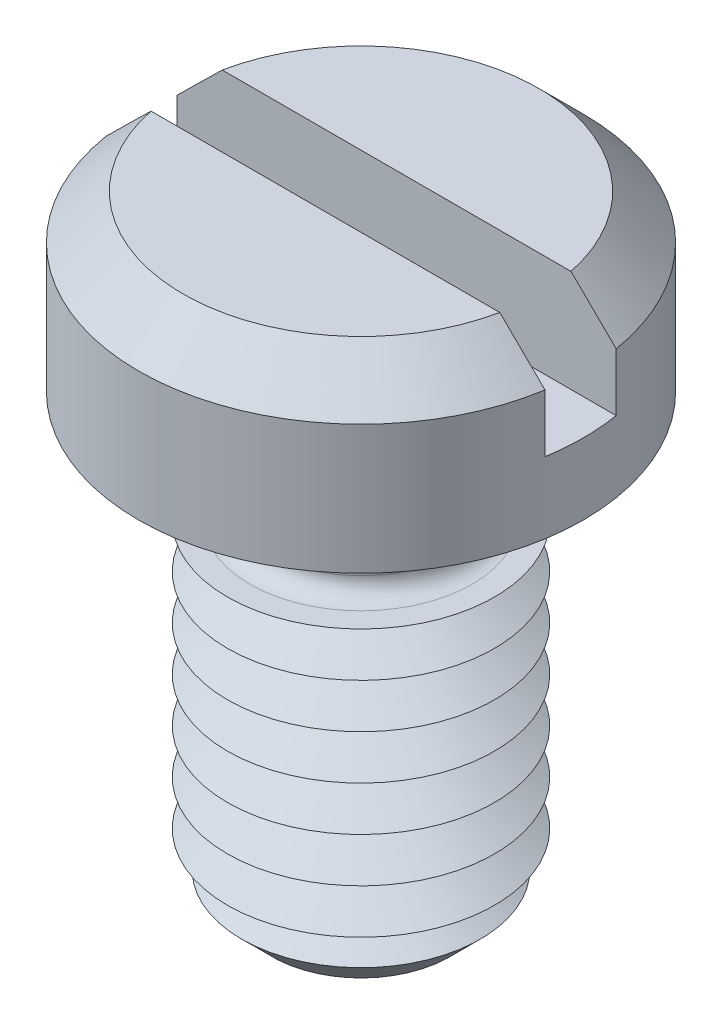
ISO-10303-21;
HEADER;
FILE_DESCRIPTION(('STEP AP214'),'2;1');
FILE_NAME('part.step','',(''),(''),'','','');
FILE_SCHEMA(('AUTOMOTIVE_DESIGN { 1 0 10303 214 1 1 1 1 }'));
ENDSEC;
DATA;
#1=APPLICATION_CONTEXT('core data for automotive mechanical design processes');
#2=APPLICATION_PROTOCOL_DEFINITION('international standard','automotive_design',2000,#1);
#3=PRODUCT_CONTEXT('',#1,'mechanical');
#4=PRODUCT('Part','Part','',(#3));
#5=PRODUCT_RELATED_PRODUCT_CATEGORY('part','',(#4));
#6=PRODUCT_DEFINITION_FORMATION('','',#4);
#7=PRODUCT_DEFINITION_CONTEXT('part definition',#1,'design');
#8=PRODUCT_DEFINITION('design','',#6,#7);
#9=PRODUCT_DEFINITION_SHAPE('','',#8);
#10=(LENGTH_UNIT() NAMED_UNIT(*) SI_UNIT(.MILLI.,.METRE.));
#11=(NAMED_UNIT(*) PLANE_ANGLE_UNIT() SI_UNIT($,.RADIAN.));
#12=(NAMED_UNIT(*) SI_UNIT($,.STERADIAN.) SOLID_ANGLE_UNIT());
#13=UNCERTAINTY_MEASURE_WITH_UNIT(LENGTH_MEASURE(1.E-05),#10,'distance_accuracy_value','');
#14=(GEOMETRIC_REPRESENTATION_CONTEXT(3) GLOBAL_UNCERTAINTY_ASSIGNED_CONTEXT((#13)) GLOBAL_UNIT_ASSIGNED_CONTEXT((#10,
#11,#12)) REPRESENTATION_CONTEXT('',''));
#15=CARTESIAN_POINT('',(0.,0.,0.));
#16=DIRECTION('',(0.,0.,1.));
#17=DIRECTION('',(1.,0.,0.));
#18=AXIS2_PLACEMENT_3D('',#15,#16,#17);
#19=CARTESIAN_POINT('',(0.,3.9,0.));
#20=DIRECTION('',(0.,1.,0.));
#21=DIRECTION('',(0.,0.,1.));
#22=AXIS2_PLACEMENT_3D('',#19,#20,#21);
#23=PLANE('',#22);
#24=DIRECTION('',(-1.,0.,0.));
#25=VECTOR('',#24,1.);
#26=CARTESIAN_POINT('',(5.,3.9,-0.8));
#27=LINE('',#26,#25);
#28=CARTESIAN_POINT('',(3.91918358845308,3.9,-0.8));
#29=VERTEX_POINT('',#28);
#30=CARTESIAN_POINT('',(-3.91918358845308,3.9,-0.8));
#31=VERTEX_POINT('',#30);
#32=EDGE_CURVE('E110',#29,#31,#27,.T.);
#33=ORIENTED_EDGE('',*,*,#32,.F.);
#34=CARTESIAN_POINT('',(0.,3.9,0.));
#35=DIRECTION('',(0.,1.,0.));
#36=DIRECTION('',(0.,0.,1.));
#37=AXIS2_PLACEMENT_3D('',#34,#35,#36);
#38=CIRCLE('',#37,4.);
#39=EDGE_CURVE('E113',#29,#31,#38,.T.);
#40=ORIENTED_EDGE('',*,*,#39,.T.);
#41=EDGE_LOOP('',(#33,#40));
#42=FACE_BOUND('',#41,.T.);
#43=ADVANCED_FACE('F39',(#42),#23,.T.);
#44=CARTESIAN_POINT('',(0.,3.9,0.));
#45=DIRECTION('',(0.,-1.,0.));
#46=DIRECTION('',(0.,0.,-1.));
#47=AXIS2_PLACEMENT_3D('',#44,#45,#46);
#48=CONICAL_SURFACE('',#47,4.,0.785398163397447);
#49=CARTESIAN_POINT('',(11.0010756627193,-3.13012537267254,-0.8));
#50=CARTESIAN_POINT('',(10.6180645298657,-2.74813121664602,-0.8));
#51=CARTESIAN_POINT('',(10.2350087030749,-2.36618183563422,-0.8));
#52=CARTESIAN_POINT('',(9.46873746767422,-1.60241986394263,-0.8));
#53=CARTESIAN_POINT('',(9.08552205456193,-1.22060727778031,-0.8));
#54=CARTESIAN_POINT('',(8.31861292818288,-0.456918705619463,-0.8));
#55=CARTESIAN_POINT('',(7.93491906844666,-0.0750428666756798,-0.8));
#56=CARTESIAN_POINT('',(7.16722555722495,0.688378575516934,-0.8));
#57=CARTESIAN_POINT('',(6.78322591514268,1.06992418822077,-0.8));
#58=CARTESIAN_POINT('',(6.01856215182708,1.82868912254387,-0.8));
#59=CARTESIAN_POINT('',(5.63790309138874,2.20591354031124,-0.8));
#60=CARTESIAN_POINT('',(5.06622054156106,2.7710831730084,-0.8));
#61=CARTESIAN_POINT('',(4.87553531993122,2.9593704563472,-0.8));
#62=CARTESIAN_POINT('',(4.49384424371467,3.33561647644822,-0.8));
#63=CARTESIAN_POINT('',(4.302838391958,3.52357521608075,-0.8));
#64=CARTESIAN_POINT('',(3.92044271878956,3.89893397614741,-0.8));
#65=CARTESIAN_POINT('',(3.7290531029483,4.08633420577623,-0.8));
#66=CARTESIAN_POINT('',(3.34554223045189,4.46039762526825,-0.8));
#67=CARTESIAN_POINT('',(3.15342094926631,4.64706078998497,-0.8));
#68=CARTESIAN_POINT('',(2.76802565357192,5.01913697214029,-0.8));
#69=CARTESIAN_POINT('',(2.57475182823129,5.20455018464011,-0.8));
#70=CARTESIAN_POINT('',(2.28318236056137,5.4809110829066,-0.8));
#71=CARTESIAN_POINT('',(2.1857187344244,5.57273577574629,-0.8));
#72=CARTESIAN_POINT('',(1.98998431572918,5.75552004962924,-0.8));
#73=CARTESIAN_POINT('',(1.89171354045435,5.84647964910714,-0.8));
#74=CARTESIAN_POINT('',(1.76578543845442,5.96147491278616,-0.8));
#75=CARTESIAN_POINT('',(1.73869031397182,5.98612635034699,-0.8));
#76=CARTESIAN_POINT('',(1.68439529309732,6.0353137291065,-0.8));
#77=CARTESIAN_POINT('',(1.65719539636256,6.05984966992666,-0.8));
#78=CARTESIAN_POINT('',(1.57541627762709,6.13326356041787,-0.8));
#79=CARTESIAN_POINT('',(1.52066027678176,6.18194515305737,-0.8));
#80=CARTESIAN_POINT('',(1.41038257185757,6.27874171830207,-0.8));
#81=CARTESIAN_POINT('',(1.35485918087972,6.32685477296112,-0.8));
#82=CARTESIAN_POINT('',(1.24299231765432,6.42210730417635,-0.8));
#83=CARTESIAN_POINT('',(1.18664895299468,6.46924690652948,-0.8));
#84=CARTESIAN_POINT('',(1.07845249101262,6.55754663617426,-0.8));
#85=CARTESIAN_POINT('',(1.02670624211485,6.59883713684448,-0.8));
#86=CARTESIAN_POINT('',(0.921961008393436,6.67979338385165,-0.8));
#87=CARTESIAN_POINT('',(0.868962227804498,6.71945939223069,-0.8));
#88=CARTESIAN_POINT('',(0.761295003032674,6.79630361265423,-0.8));
#89=CARTESIAN_POINT('',(0.706629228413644,6.83348552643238,-0.8));
#90=CARTESIAN_POINT('',(0.594896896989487,6.90399895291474,-0.8));
#91=CARTESIAN_POINT('',(0.5378333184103,6.93733506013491,-0.8));
#92=CARTESIAN_POINT('',(0.428390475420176,6.99356340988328,-0.8));
#93=CARTESIAN_POINT('',(0.376435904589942,7.01726022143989,-0.8));
#94=CARTESIAN_POINT('',(0.269759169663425,7.05717670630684,-0.8));
#95=CARTESIAN_POINT('',(0.215046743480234,7.07342088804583,-0.8));
#96=CARTESIAN_POINT('',(0.113016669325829,7.09332110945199,-0.8));
#97=CARTESIAN_POINT('',(0.066043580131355,7.09866042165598,-0.8));
#98=CARTESIAN_POINT('',(-0.0280587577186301,7.10088875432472,-0.8));
#99=CARTESIAN_POINT('',(-0.0751877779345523,7.09778705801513,-0.8));
#100=CARTESIAN_POINT('',(-0.180723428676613,7.08192474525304,-0.8));
#101=CARTESIAN_POINT('',(-0.238762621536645,7.06679554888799,-0.8));
#102=CARTESIAN_POINT('',(-0.32349937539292,7.03748409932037,-0.8));
#103=CARTESIAN_POINT('',(-0.351441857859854,7.0265659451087,-0.8));
#104=CARTESIAN_POINT('',(-0.40656991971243,7.00295901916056,-0.8));
#105=CARTESIAN_POINT('',(-0.433755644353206,6.99027059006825,-0.8));
#106=CARTESIAN_POINT('',(-0.504673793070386,6.95489235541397,-0.8));
#107=CARTESIAN_POINT('',(-0.547808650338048,6.93101671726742,-0.8));
#108=CARTESIAN_POINT('',(-0.632566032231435,6.88069648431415,-0.8));
#109=CARTESIAN_POINT('',(-0.674187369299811,6.85424992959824,-0.8));
#110=CARTESIAN_POINT('',(-0.756326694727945,6.79950439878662,-0.8));
#111=CARTESIAN_POINT('',(-0.796841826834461,6.77120117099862,-0.8));
#112=CARTESIAN_POINT('',(-0.876938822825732,6.71329852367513,-0.8));
#113=CARTESIAN_POINT('',(-0.916520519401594,6.68369887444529,-0.8));
#114=CARTESIAN_POINT('',(-1.03465904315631,6.59312324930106,-0.8));
#115=CARTESIAN_POINT('',(-1.11211338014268,6.5307142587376,-0.8));
#116=CARTESIAN_POINT('',(-1.26505454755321,6.40381418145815,-0.8));
#117=CARTESIAN_POINT('',(-1.34054439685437,6.33932667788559,-0.8));
#118=CARTESIAN_POINT('',(-1.48913173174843,6.20997083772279,-0.8));
#119=CARTESIAN_POINT('',(-1.5622481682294,6.14512422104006,-0.8));
#120=CARTESIAN_POINT('',(-1.70765393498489,6.01451044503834,-0.8));
#121=CARTESIAN_POINT('',(-1.77994324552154,5.94874326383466,-0.8));
#122=CARTESIAN_POINT('',(-1.99594639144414,5.75046596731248,-0.8));
#123=CARTESIAN_POINT('',(-2.13877767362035,5.61699583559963,-0.8));
#124=CARTESIAN_POINT('',(-2.42324632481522,5.34853800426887,-0.8));
#125=CARTESIAN_POINT('',(-2.56488247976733,5.21354902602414,-0.8));
#126=CARTESIAN_POINT('',(-2.84730929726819,4.94270932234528,-0.8));
#127=CARTESIAN_POINT('',(-2.98810001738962,4.80685865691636,-0.8));
#128=CARTESIAN_POINT('',(-3.26818763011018,4.53549974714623,-0.8));
#129=CARTESIAN_POINT('',(-3.40748821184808,4.39999530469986,-0.8));
#130=CARTESIAN_POINT('',(-3.68570899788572,4.12859172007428,-0.8));
#131=CARTESIAN_POINT('',(-3.82462919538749,3.99269257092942,-0.8));
#132=CARTESIAN_POINT('',(-4.24087543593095,3.58468153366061,-0.8));
#133=CARTESIAN_POINT('',(-4.51779300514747,3.31215310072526,-0.8));
#134=CARTESIAN_POINT('',(-5.05279381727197,2.78443938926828,-0.8));
#135=CARTESIAN_POINT('',(-5.31091639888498,2.52929393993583,-0.8));
#136=CARTESIAN_POINT('',(-5.82680751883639,2.01864429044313,-0.8));
#137=CARTESIAN_POINT('',(-6.08457605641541,1.76314008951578,-0.8));
#138=CARTESIAN_POINT('',(-6.85760508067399,0.996194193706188,-0.8));
#139=CARTESIAN_POINT('',(-7.37251152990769,0.484395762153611,-0.8));
#140=CARTESIAN_POINT('',(-8.40657233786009,-0.544392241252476,-0.8));
#141=CARTESIAN_POINT('',(-8.92572224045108,-1.06138628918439,-0.8));
#142=CARTESIAN_POINT('',(-9.9636287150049,-2.09560660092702,-0.8));
#143=CARTESIAN_POINT('',(-10.4823853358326,-2.61283281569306,-0.8));
#144=CARTESIAN_POINT('',(-11.0010756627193,-3.13012537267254,-0.8));
#145=B_SPLINE_CURVE_WITH_KNOTS('',3,(#49,#50,#51,#52,#53,#54,#55,#56,#57,#58,#59,#60,#61,#62,
#63,#64,#65,#66,#67,#68,#69,#70,#71,#72,#73,#74,#75,#76,#77,#78,#79,#80,#81,#82,#83,#84,#85,#86,
#87,#88,#89,#90,#91,#92,#93,#94,#95,#96,#97,#98,#99,#100,#101,#102,#103,#104,#105,#106,#107,
#108,#109,#110,#111,#112,#113,#114,#115,#116,#117,#118,#119,#120,#121,#122,#123,#124,#125,#126,
#127,#128,#129,#130,#131,#132,#133,#134,#135,#136,#137,#138,#139,#140,#141,#142,#143,#144),
.UNSPECIFIED.,.F.,.F.,(4,2,2,2,2,2,2,2,2,2,2,2,2,2,2,2,2,2,2,2,2,2,2,2,2,2,2,2,2,2,2,2,2,2,2,2,
2,2,2,2,2,2,2,2,2,2,2,4),(0.,1.62282275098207,3.24569489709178,4.86971791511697,
6.49369278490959,8.10142191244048,8.90535980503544,9.7092906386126,10.5128682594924,
11.3164730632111,12.1199494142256,12.5216659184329,12.9233738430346,13.0332669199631,
13.1431603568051,13.3629580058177,13.5833578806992,13.8037290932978,14.0023112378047,
14.2008612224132,14.3991084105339,14.5971162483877,14.7680800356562,14.9384774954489,
15.0795987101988,15.2205647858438,15.3993585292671,15.4893211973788,15.579266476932,
15.727032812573,15.8749126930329,16.0231439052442,16.1714014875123,16.4697244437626,
16.767558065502,17.0607348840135,17.35391868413,17.9403574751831,18.5273336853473,
19.1142694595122,19.6972736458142,20.2802881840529,21.4458742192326,22.5346981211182,
23.6235243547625,25.8015035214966,27.9995014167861,30.1971550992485),.UNSPECIFIED.);
#146=CARTESIAN_POINT('',(4.93558507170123,2.9,-0.8));
#147=VERTEX_POINT('',#146);
#148=EDGE_CURVE('E252',#147,#29,#145,.T.);
#149=ORIENTED_EDGE('',*,*,#148,.F.);
#150=CARTESIAN_POINT('',(0.,2.9,0.));
#151=DIRECTION('',(0.,1.,0.));
#152=DIRECTION('',(0.,0.,1.));
#153=AXIS2_PLACEMENT_3D('',#150,#151,#152);
#154=CIRCLE('',#153,5.);
#155=CARTESIAN_POINT('',(-4.93558507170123,2.9,-0.8));
#156=VERTEX_POINT('',#155);
#157=EDGE_CURVE('E128',#156,#147,#154,.F.);
#158=ORIENTED_EDGE('',*,*,#157,.F.);
#159=EDGE_CURVE('E102',#31,#156,#145,.T.);
#160=ORIENTED_EDGE('',*,*,#159,.F.);
#161=ORIENTED_EDGE('',*,*,#39,.F.);
#162=EDGE_LOOP('',(#149,#158,#160,#161));
#163=FACE_BOUND('',#162,.T.);
#164=ADVANCED_FACE('F214',(#163),#48,.T.);
#165=CARTESIAN_POINT('',(0.,-10.,0.));
#166=DIRECTION('',(0.,1.,0.));
#167=DIRECTION('',(0.,0.,1.));
#168=AXIS2_PLACEMENT_3D('',#165,#166,#167);
#169=CYLINDRICAL_SURFACE('',#168,2.1);
#170=CARTESIAN_POINT('',(0.,-2.1,0.));
#171=DIRECTION('',(0.,-1.,0.));
#172=DIRECTION('',(0.,0.,-1.));
#173=AXIS2_PLACEMENT_3D('',#170,#171,#172);
#174=CIRCLE('',#173,2.1);
#175=CARTESIAN_POINT('',(0.,-2.1,-2.1));
#176=VERTEX_POINT('',#175);
#177=EDGE_CURVE('E123',#176,#176,#174,.F.);
#178=ORIENTED_EDGE('',*,*,#177,.T.);
#179=EDGE_LOOP('',(#178));
#180=FACE_BOUND('',#179,.T.);
#181=CARTESIAN_POINT('',(0.,-0.399999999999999,0.));
#182=DIRECTION('',(0.,1.,0.));
#183=DIRECTION('',(0.,0.,1.));
#184=AXIS2_PLACEMENT_3D('',#181,#182,#183);
#185=CIRCLE('',#184,2.1);
#186=CARTESIAN_POINT('',(0.,-0.399999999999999,2.1));
#187=VERTEX_POINT('',#186);
#188=EDGE_CURVE('E350',#187,#187,#185,.F.);
#189=ORIENTED_EDGE('',*,*,#188,.T.);
#190=EDGE_LOOP('',(#189));
#191=FACE_BOUND('',#190,.T.);
#192=ADVANCED_FACE('F210',(#180,#191),#169,.T.);
#193=CARTESIAN_POINT('',(0.,3.9,0.));
#194=DIRECTION('',(0.,-1.,0.));
#195=DIRECTION('',(0.,0.,-1.));
#196=AXIS2_PLACEMENT_3D('',#193,#194,#195);
#197=CYLINDRICAL_SURFACE('',#196,5.);
#198=ORIENTED_EDGE('',*,*,#157,.T.);
#199=DIRECTION('',(0.,-1.,0.));
#200=VECTOR('',#199,1.);
#201=CARTESIAN_POINT('',(4.93558507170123,3.9,-0.8));
#202=LINE('',#201,#200);
#203=CARTESIAN_POINT('',(4.93558507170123,1.6,-0.8));
#204=VERTEX_POINT('',#203);
#205=EDGE_CURVE('E64',#147,#204,#202,.T.);
#206=ORIENTED_EDGE('',*,*,#205,.T.);
#207=CARTESIAN_POINT('',(0.,1.6,0.));
#208=DIRECTION('',(0.,1.,0.));
#209=DIRECTION('',(0.,0.,1.));
#210=AXIS2_PLACEMENT_3D('',#207,#208,#209);
#211=CIRCLE('',#210,5.);
#212=CARTESIAN_POINT('',(4.93558507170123,1.6,0.8));
#213=VERTEX_POINT('',#212);
#214=EDGE_CURVE('E11',#213,#204,#211,.T.);
#215=ORIENTED_EDGE('',*,*,#214,.F.);
#216=DIRECTION('',(0.,-1.,0.));
#217=VECTOR('',#216,1.);
#218=CARTESIAN_POINT('',(4.93558507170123,3.9,0.8));
#219=LINE('',#218,#217);
#220=CARTESIAN_POINT('',(4.93558507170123,2.9,0.8));
#221=VERTEX_POINT('',#220);
#222=EDGE_CURVE('E268',#213,#221,#219,.F.);
#223=ORIENTED_EDGE('',*,*,#222,.T.);
#224=CARTESIAN_POINT('',(-4.93558507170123,2.9,0.8));
#225=VERTEX_POINT('',#224);
#226=EDGE_CURVE('E120',#221,#225,#154,.F.);
#227=ORIENTED_EDGE('',*,*,#226,.T.);
#228=DIRECTION('',(0.,-1.,0.));
#229=VECTOR('',#228,1.);
#230=CARTESIAN_POINT('',(-4.93558507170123,3.9,0.8));
#231=LINE('',#230,#229);
#232=CARTESIAN_POINT('',(-4.93558507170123,1.6,0.8));
#233=VERTEX_POINT('',#232);
#234=EDGE_CURVE('E96',#225,#233,#231,.T.);
#235=ORIENTED_EDGE('',*,*,#234,.T.);
#236=CARTESIAN_POINT('',(-4.93558507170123,1.6,-0.8));
#237=VERTEX_POINT('',#236);
#238=EDGE_CURVE('E44',#237,#233,#211,.T.);
#239=ORIENTED_EDGE('',*,*,#238,.F.);
#240=DIRECTION('',(0.,-1.,0.));
#241=VECTOR('',#240,1.);
#242=CARTESIAN_POINT('',(-4.93558507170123,3.9,-0.8));
#243=LINE('',#242,#241);
#244=EDGE_CURVE('E272',#237,#156,#243,.F.);
#245=ORIENTED_EDGE('',*,*,#244,.T.);
#246=EDGE_LOOP('',(#198,#206,#215,#223,#227,#235,#239,#245));
#247=FACE_BOUND('',#246,.T.);
#248=CARTESIAN_POINT('',(0.,0.,0.));
#249=DIRECTION('',(0.,1.,0.));
#250=DIRECTION('',(0.,0.,1.));
#251=AXIS2_PLACEMENT_3D('',#248,#249,#250);
#252=CIRCLE('',#251,5.);
#253=CARTESIAN_POINT('',(0.,0.,5.));
#254=VERTEX_POINT('',#253);
#255=EDGE_CURVE('E335',#254,#254,#252,.T.);
#256=ORIENTED_EDGE('',*,*,#255,.T.);
#257=EDGE_LOOP('',(#256));
#258=FACE_BOUND('',#257,.T.);
#259=ADVANCED_FACE('F213',(#247,#258),#197,.T.);
#260=DIRECTION('',(1.,0.,0.));
#261=VECTOR('',#260,1.);
#262=CARTESIAN_POINT('',(5.,3.9,0.8));
#263=LINE('',#262,#261);
#264=CARTESIAN_POINT('',(-3.91918358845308,3.9,0.8));
#265=VERTEX_POINT('',#264);
#266=CARTESIAN_POINT('',(3.91918358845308,3.9,0.8));
#267=VERTEX_POINT('',#266);
#268=EDGE_CURVE('E56',#265,#267,#263,.T.);
#269=ORIENTED_EDGE('',*,*,#268,.F.);
#270=EDGE_CURVE('E108',#265,#267,#38,.T.);
#271=ORIENTED_EDGE('',*,*,#270,.T.);
#272=EDGE_LOOP('',(#269,#271));
#273=FACE_BOUND('',#272,.T.);
#274=ADVANCED_FACE('F107',(#273),#23,.T.);
#275=CARTESIAN_POINT('',(0.,0.,0.));
#276=DIRECTION('',(0.,1.,0.));
#277=DIRECTION('',(0.,0.,1.));
#278=AXIS2_PLACEMENT_3D('',#275,#276,#277);
#279=PLANE('',#278);
#280=CARTESIAN_POINT('',(0.,0.,0.));
#281=DIRECTION('',(0.,1.,0.));
#282=DIRECTION('',(0.,0.,1.));
#283=AXIS2_PLACEMENT_3D('',#280,#281,#282);
#284=CIRCLE('',#283,2.5);
#285=CARTESIAN_POINT('',(0.,0.,2.5));
#286=VERTEX_POINT('',#285);
#287=EDGE_CURVE('E114',#286,#286,#284,.T.);
#288=ORIENTED_EDGE('',*,*,#287,.T.);
#289=EDGE_LOOP('',(#288));
#290=FACE_BOUND('',#289,.T.);
#291=ORIENTED_EDGE('',*,*,#255,.F.);
#292=EDGE_LOOP('',(#291));
#293=FACE_BOUND('',#292,.T.);
#294=ADVANCED_FACE('F204',(#290,#293),#279,.F.);
#295=CARTESIAN_POINT('',(0.,-2.5,0.));
#296=DIRECTION('',(0.,-1.,0.));
#297=DIRECTION('',(0.,0.,-1.));
#298=AXIS2_PLACEMENT_3D('',#295,#296,#297);
#299=PLANE('',#298);
#300=CARTESIAN_POINT('',(0.,-2.5,0.));
#301=DIRECTION('',(0.,-1.,0.));
#302=DIRECTION('',(0.,0.,-1.));
#303=AXIS2_PLACEMENT_3D('',#300,#301,#302);
#304=CIRCLE('',#303,2.5);
#305=CARTESIAN_POINT('',(0.,-2.5,-2.5));
#306=VERTEX_POINT('',#305);
#307=EDGE_CURVE('E343',#306,#306,#304,.T.);
#308=ORIENTED_EDGE('',*,*,#307,.T.);
#309=EDGE_LOOP('',(#308));
#310=FACE_BOUND('',#309,.T.);
#311=CARTESIAN_POINT('',(0.,-2.5,0.));
#312=DIRECTION('',(0.,1.,0.));
#313=DIRECTION('',(0.,0.,1.));
#314=AXIS2_PLACEMENT_3D('',#311,#312,#313);
#315=CIRCLE('',#314,3.);
#316=CARTESIAN_POINT('',(0.,-2.5,3.));
#317=VERTEX_POINT('',#316);
#318=EDGE_CURVE('E331',#317,#317,#315,.T.);
#319=ORIENTED_EDGE('',*,*,#318,.T.);
#320=EDGE_LOOP('',(#319));
#321=FACE_BOUND('',#320,.T.);
#322=ADVANCED_FACE('F200',(#310,#321),#299,.F.);
#323=CARTESIAN_POINT('',(0.,-3.,0.));
#324=DIRECTION('',(0.,1.,0.));
#325=DIRECTION('',(0.,0.,1.));
#326=AXIS2_PLACEMENT_3D('',#323,#324,#325);
#327=CONICAL_SURFACE('',#326,2.13397459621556,1.0471975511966);
#328=ORIENTED_EDGE('',*,*,#318,.F.);
#329=EDGE_LOOP('',(#328));
#330=FACE_BOUND('',#329,.T.);
#331=CARTESIAN_POINT('',(0.,-3.,0.));
#332=DIRECTION('',(0.,1.,0.));
#333=DIRECTION('',(0.,0.,1.));
#334=AXIS2_PLACEMENT_3D('',#331,#332,#333);
#335=CIRCLE('',#334,2.13397459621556);
#336=CARTESIAN_POINT('',(0.,-3.,2.13397459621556));
#337=VERTEX_POINT('',#336);
#338=EDGE_CURVE('E327',#337,#337,#335,.T.);
#339=ORIENTED_EDGE('',*,*,#338,.T.);
#340=EDGE_LOOP('',(#339));
#341=FACE_BOUND('',#340,.T.);
#342=ADVANCED_FACE('F196',(#330,#341),#327,.T.);
#343=CARTESIAN_POINT('',(0.,-3.5,0.));
#344=DIRECTION('',(0.,-1.,0.));
#345=DIRECTION('',(0.,0.,-1.));
#346=AXIS2_PLACEMENT_3D('',#343,#344,#345);
#347=CONICAL_SURFACE('',#346,3.,1.0471975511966);
#348=ORIENTED_EDGE('',*,*,#338,.F.);
#349=EDGE_LOOP('',(#348));
#350=FACE_BOUND('',#349,.T.);
#351=CARTESIAN_POINT('',(0.,-3.5,0.));
#352=DIRECTION('',(0.,1.,0.));
#353=DIRECTION('',(0.,0.,1.));
#354=AXIS2_PLACEMENT_3D('',#351,#352,#353);
#355=CIRCLE('',#354,3.);
#356=CARTESIAN_POINT('',(0.,-3.5,3.));
#357=VERTEX_POINT('',#356);
#358=EDGE_CURVE('E323',#357,#357,#355,.T.);
#359=ORIENTED_EDGE('',*,*,#358,.T.);
#360=EDGE_LOOP('',(#359));
#361=FACE_BOUND('',#360,.T.);
#362=ADVANCED_FACE('F192',(#350,#361),#347,.T.);
#363=CARTESIAN_POINT('',(0.,-4.,0.));
#364=DIRECTION('',(0.,1.,0.));
#365=DIRECTION('',(0.,0.,1.));
#366=AXIS2_PLACEMENT_3D('',#363,#364,#365);
#367=CONICAL_SURFACE('',#366,2.13397459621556,1.0471975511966);
#368=ORIENTED_EDGE('',*,*,#358,.F.);
#369=EDGE_LOOP('',(#368));
#370=FACE_BOUND('',#369,.T.);
#371=CARTESIAN_POINT('',(0.,-4.,0.));
#372=DIRECTION('',(0.,1.,0.));
#373=DIRECTION('',(0.,0.,1.));
#374=AXIS2_PLACEMENT_3D('',#371,#372,#373);
#375=CIRCLE('',#374,2.13397459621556);
#376=CARTESIAN_POINT('',(0.,-4.,2.13397459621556));
#377=VERTEX_POINT('',#376);
#378=EDGE_CURVE('E319',#377,#377,#375,.T.);
#379=ORIENTED_EDGE('',*,*,#378,.T.);
#380=EDGE_LOOP('',(#379));
#381=FACE_BOUND('',#380,.T.);
#382=ADVANCED_FACE('F188',(#370,#381),#367,.T.);
#383=CARTESIAN_POINT('',(0.,-4.5,0.));
#384=DIRECTION('',(0.,-1.,0.));
#385=DIRECTION('',(0.,0.,-1.));
#386=AXIS2_PLACEMENT_3D('',#383,#384,#385);
#387=CONICAL_SURFACE('',#386,3.,1.0471975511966);
#388=ORIENTED_EDGE('',*,*,#378,.F.);
#389=EDGE_LOOP('',(#388));
#390=FACE_BOUND('',#389,.T.);
#391=CARTESIAN_POINT('',(0.,-4.5,0.));
#392=DIRECTION('',(0.,1.,0.));
#393=DIRECTION('',(0.,0.,1.));
#394=AXIS2_PLACEMENT_3D('',#391,#392,#393);
#395=CIRCLE('',#394,3.);
#396=CARTESIAN_POINT('',(0.,-4.5,3.));
#397=VERTEX_POINT('',#396);
#398=EDGE_CURVE('E315',#397,#397,#395,.T.);
#399=ORIENTED_EDGE('',*,*,#398,.T.);
#400=EDGE_LOOP('',(#399));
#401=FACE_BOUND('',#400,.T.);
#402=ADVANCED_FACE('F184',(#390,#401),#387,.T.);
#403=CARTESIAN_POINT('',(0.,-5.,0.));
#404=DIRECTION('',(0.,1.,0.));
#405=DIRECTION('',(0.,0.,1.));
#406=AXIS2_PLACEMENT_3D('',#403,#404,#405);
#407=CONICAL_SURFACE('',#406,2.13397459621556,1.0471975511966);
#408=ORIENTED_EDGE('',*,*,#398,.F.);
#409=EDGE_LOOP('',(#408));
#410=FACE_BOUND('',#409,.T.);
#411=CARTESIAN_POINT('',(0.,-5.,0.));
#412=DIRECTION('',(0.,1.,0.));
#413=DIRECTION('',(0.,0.,1.));
#414=AXIS2_PLACEMENT_3D('',#411,#412,#413);
#415=CIRCLE('',#414,2.13397459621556);
#416=CARTESIAN_POINT('',(0.,-5.,2.13397459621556));
#417=VERTEX_POINT('',#416);
#418=EDGE_CURVE('E311',#417,#417,#415,.T.);
#419=ORIENTED_EDGE('',*,*,#418,.T.);
#420=EDGE_LOOP('',(#419));
#421=FACE_BOUND('',#420,.T.);
#422=ADVANCED_FACE('F180',(#410,#421),#407,.T.);
#423=CARTESIAN_POINT('',(0.,-5.5,0.));
#424=DIRECTION('',(0.,-1.,0.));
#425=DIRECTION('',(0.,0.,-1.));
#426=AXIS2_PLACEMENT_3D('',#423,#424,#425);
#427=CONICAL_SURFACE('',#426,3.,1.0471975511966);
#428=ORIENTED_EDGE('',*,*,#418,.F.);
#429=EDGE_LOOP('',(#428));
#430=FACE_BOUND('',#429,.T.);
#431=CARTESIAN_POINT('',(0.,-5.5,0.));
#432=DIRECTION('',(0.,1.,0.));
#433=DIRECTION('',(0.,0.,1.));
#434=AXIS2_PLACEMENT_3D('',#431,#432,#433);
#435=CIRCLE('',#434,3.);
#436=CARTESIAN_POINT('',(0.,-5.5,3.));
#437=VERTEX_POINT('',#436);
#438=EDGE_CURVE('E308',#437,#437,#435,.T.);
#439=ORIENTED_EDGE('',*,*,#438,.T.);
#440=EDGE_LOOP('',(#439));
#441=FACE_BOUND('',#440,.T.);
#442=ADVANCED_FACE('F176',(#430,#441),#427,.T.);
#443=CARTESIAN_POINT('',(0.,-6.,0.));
#444=DIRECTION('',(0.,1.,0.));
#445=DIRECTION('',(0.,0.,1.));
#446=AXIS2_PLACEMENT_3D('',#443,#444,#445);
#447=CONICAL_SURFACE('',#446,2.13397459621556,1.0471975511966);
#448=ORIENTED_EDGE('',*,*,#438,.F.);
#449=EDGE_LOOP('',(#448));
#450=FACE_BOUND('',#449,.T.);
#451=CARTESIAN_POINT('',(0.,-6.,0.));
#452=DIRECTION('',(0.,1.,0.));
#453=DIRECTION('',(0.,0.,1.));
#454=AXIS2_PLACEMENT_3D('',#451,#452,#453);
#455=CIRCLE('',#454,2.13397459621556);
#456=CARTESIAN_POINT('',(0.,-6.,2.13397459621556));
#457=VERTEX_POINT('',#456);
#458=EDGE_CURVE('E304',#457,#457,#455,.T.);
#459=ORIENTED_EDGE('',*,*,#458,.T.);
#460=EDGE_LOOP('',(#459));
#461=FACE_BOUND('',#460,.T.);
#462=ADVANCED_FACE('F172',(#450,#461),#447,.T.);
#463=CARTESIAN_POINT('',(0.,-6.5,0.));
#464=DIRECTION('',(0.,-1.,0.));
#465=DIRECTION('',(0.,0.,-1.));
#466=AXIS2_PLACEMENT_3D('',#463,#464,#465);
#467=CONICAL_SURFACE('',#466,3.,1.0471975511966);
#468=ORIENTED_EDGE('',*,*,#458,.F.);
#469=EDGE_LOOP('',(#468));
#470=FACE_BOUND('',#469,.T.);
#471=CARTESIAN_POINT('',(0.,-6.5,0.));
#472=DIRECTION('',(0.,1.,0.));
#473=DIRECTION('',(0.,0.,1.));
#474=AXIS2_PLACEMENT_3D('',#471,#472,#473);
#475=CIRCLE('',#474,3.);
#476=CARTESIAN_POINT('',(0.,-6.5,3.));
#477=VERTEX_POINT('',#476);
#478=EDGE_CURVE('E300',#477,#477,#475,.T.);
#479=ORIENTED_EDGE('',*,*,#478,.T.);
#480=EDGE_LOOP('',(#479));
#481=FACE_BOUND('',#480,.T.);
#482=ADVANCED_FACE('F168',(#470,#481),#467,.T.);
#483=CARTESIAN_POINT('',(0.,-7.,0.));
#484=DIRECTION('',(0.,1.,0.));
#485=DIRECTION('',(0.,0.,1.));
#486=AXIS2_PLACEMENT_3D('',#483,#484,#485);
#487=CONICAL_SURFACE('',#486,2.13397459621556,1.0471975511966);
#488=ORIENTED_EDGE('',*,*,#478,.F.);
#489=EDGE_LOOP('',(#488));
#490=FACE_BOUND('',#489,.T.);
#491=CARTESIAN_POINT('',(0.,-7.,0.));
#492=DIRECTION('',(0.,1.,0.));
#493=DIRECTION('',(0.,0.,1.));
#494=AXIS2_PLACEMENT_3D('',#491,#492,#493);
#495=CIRCLE('',#494,2.13397459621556);
#496=CARTESIAN_POINT('',(0.,-7.,2.13397459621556));
#497=VERTEX_POINT('',#496);
#498=EDGE_CURVE('E296',#497,#497,#495,.T.);
#499=ORIENTED_EDGE('',*,*,#498,.T.);
#500=EDGE_LOOP('',(#499));
#501=FACE_BOUND('',#500,.T.);
#502=ADVANCED_FACE('F164',(#490,#501),#487,.T.);
#503=CARTESIAN_POINT('',(0.,-7.5,0.));
#504=DIRECTION('',(0.,-1.,0.));
#505=DIRECTION('',(0.,0.,-1.));
#506=AXIS2_PLACEMENT_3D('',#503,#504,#505);
#507=CONICAL_SURFACE('',#506,3.,1.0471975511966);
#508=ORIENTED_EDGE('',*,*,#498,.F.);
#509=EDGE_LOOP('',(#508));
#510=FACE_BOUND('',#509,.T.);
#511=CARTESIAN_POINT('',(0.,-7.5,0.));
#512=DIRECTION('',(0.,1.,0.));
#513=DIRECTION('',(0.,0.,1.));
#514=AXIS2_PLACEMENT_3D('',#511,#512,#513);
#515=CIRCLE('',#514,3.);
#516=CARTESIAN_POINT('',(0.,-7.5,3.));
#517=VERTEX_POINT('',#516);
#518=EDGE_CURVE('E292',#517,#517,#515,.T.);
#519=ORIENTED_EDGE('',*,*,#518,.T.);
#520=EDGE_LOOP('',(#519));
#521=FACE_BOUND('',#520,.T.);
#522=ADVANCED_FACE('F160',(#510,#521),#507,.T.);
#523=CARTESIAN_POINT('',(0.,-8.,0.));
#524=DIRECTION('',(0.,1.,0.));
#525=DIRECTION('',(0.,0.,1.));
#526=AXIS2_PLACEMENT_3D('',#523,#524,#525);
#527=CONICAL_SURFACE('',#526,2.13397459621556,1.0471975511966);
#528=ORIENTED_EDGE('',*,*,#518,.F.);
#529=EDGE_LOOP('',(#528));
#530=FACE_BOUND('',#529,.T.);
#531=CARTESIAN_POINT('',(0.,-8.,0.));
#532=DIRECTION('',(0.,1.,0.));
#533=DIRECTION('',(0.,0.,1.));
#534=AXIS2_PLACEMENT_3D('',#531,#532,#533);
#535=CIRCLE('',#534,2.13397459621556);
#536=CARTESIAN_POINT('',(0.,-8.,2.13397459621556));
#537=VERTEX_POINT('',#536);
#538=EDGE_CURVE('E288',#537,#537,#535,.T.);
#539=ORIENTED_EDGE('',*,*,#538,.T.);
#540=EDGE_LOOP('',(#539));
#541=FACE_BOUND('',#540,.T.);
#542=ADVANCED_FACE('F156',(#530,#541),#527,.T.);
#543=CARTESIAN_POINT('',(0.,-8.5,0.));
#544=DIRECTION('',(0.,-1.,0.));
#545=DIRECTION('',(0.,0.,-1.));
#546=AXIS2_PLACEMENT_3D('',#543,#544,#545);
#547=CONICAL_SURFACE('',#546,3.,1.0471975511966);
#548=ORIENTED_EDGE('',*,*,#538,.F.);
#549=EDGE_LOOP('',(#548));
#550=FACE_BOUND('',#549,.T.);
#551=CARTESIAN_POINT('',(0.,-8.5,0.));
#552=DIRECTION('',(0.,1.,0.));
#553=DIRECTION('',(0.,0.,1.));
#554=AXIS2_PLACEMENT_3D('',#551,#552,#553);
#555=CIRCLE('',#554,3.);
#556=CARTESIAN_POINT('',(0.,-8.5,3.));
#557=VERTEX_POINT('',#556);
#558=EDGE_CURVE('E284',#557,#557,#555,.T.);
#559=ORIENTED_EDGE('',*,*,#558,.T.);
#560=EDGE_LOOP('',(#559));
#561=FACE_BOUND('',#560,.T.);
#562=ADVANCED_FACE('F152',(#550,#561),#547,.T.);
#563=CARTESIAN_POINT('',(0.,-9.,0.));
#564=DIRECTION('',(0.,1.,0.));
#565=DIRECTION('',(0.,0.,1.));
#566=AXIS2_PLACEMENT_3D('',#563,#564,#565);
#567=CONICAL_SURFACE('',#566,2.13397459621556,1.0471975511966);
#568=ORIENTED_EDGE('',*,*,#558,.F.);
#569=EDGE_LOOP('',(#568));
#570=FACE_BOUND('',#569,.T.);
#571=CARTESIAN_POINT('',(0.,-9.,0.));
#572=DIRECTION('',(0.,1.,0.));
#573=DIRECTION('',(0.,0.,1.));
#574=AXIS2_PLACEMENT_3D('',#571,#572,#573);
#575=CIRCLE('',#574,2.13397459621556);
#576=CARTESIAN_POINT('',(0.,-9.,2.13397459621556));
#577=VERTEX_POINT('',#576);
#578=EDGE_CURVE('E280',#577,#577,#575,.T.);
#579=ORIENTED_EDGE('',*,*,#578,.T.);
#580=EDGE_LOOP('',(#579));
#581=FACE_BOUND('',#580,.T.);
#582=ADVANCED_FACE('F148',(#570,#581),#567,.T.);
#583=CARTESIAN_POINT('',(0.,-9.5,0.));
#584=DIRECTION('',(0.,-1.,0.));
#585=DIRECTION('',(0.,0.,-1.));
#586=AXIS2_PLACEMENT_3D('',#583,#584,#585);
#587=CONICAL_SURFACE('',#586,3.,1.0471975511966);
#588=CARTESIAN_POINT('',(0.,-9.31698729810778,0.));
#589=DIRECTION('',(0.,-1.,0.));
#590=DIRECTION('',(0.,0.,-1.));
#591=AXIS2_PLACEMENT_3D('',#588,#589,#590);
#592=CIRCLE('',#591,2.68301270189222);
#593=CARTESIAN_POINT('',(0.,-9.31698729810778,-2.68301270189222));
#594=VERTEX_POINT('',#593);
#595=EDGE_CURVE('E287',#594,#594,#592,.F.);
#596=ORIENTED_EDGE('',*,*,#595,.T.);
#597=EDGE_LOOP('',(#596));
#598=FACE_BOUND('',#597,.T.);
#599=ORIENTED_EDGE('',*,*,#578,.F.);
#600=EDGE_LOOP('',(#599));
#601=FACE_BOUND('',#600,.T.);
#602=ADVANCED_FACE('F144',(#598,#601),#587,.T.);
#603=CARTESIAN_POINT('',(0.,-10.,0.));
#604=DIRECTION('',(0.,-1.,0.));
#605=DIRECTION('',(0.,0.,-1.));
#606=AXIS2_PLACEMENT_3D('',#603,#604,#605);
#607=PLANE('',#606);
#608=CARTESIAN_POINT('',(0.,-10.,0.));
#609=DIRECTION('',(0.,-1.,0.));
#610=DIRECTION('',(0.,0.,-1.));
#611=AXIS2_PLACEMENT_3D('',#608,#609,#610);
#612=CIRCLE('',#611,2.);
#613=CARTESIAN_POINT('',(0.,-10.,-2.));
#614=VERTEX_POINT('',#613);
#615=EDGE_CURVE('E339',#614,#614,#612,.T.);
#616=ORIENTED_EDGE('',*,*,#615,.T.);
#617=EDGE_LOOP('',(#616));
#618=FACE_BOUND('',#617,.T.);
#619=ADVANCED_FACE('F147',(#618),#607,.T.);
#620=CARTESIAN_POINT('',(0.,-10.,0.));
#621=DIRECTION('',(0.,1.,0.));
#622=DIRECTION('',(0.,0.,1.));
#623=AXIS2_PLACEMENT_3D('',#620,#621,#622);
#624=CONICAL_SURFACE('',#623,2.,0.785398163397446);
#625=ORIENTED_EDGE('',*,*,#595,.F.);
#626=EDGE_LOOP('',(#625));
#627=FACE_BOUND('',#626,.T.);
#628=ORIENTED_EDGE('',*,*,#615,.F.);
#629=EDGE_LOOP('',(#628));
#630=FACE_BOUND('',#629,.T.);
#631=ADVANCED_FACE('F208',(#627,#630),#624,.T.);
#632=CARTESIAN_POINT('',(0.,-2.1,0.));
#633=DIRECTION('',(0.,-1.,0.));
#634=DIRECTION('',(0.,0.,-1.));
#635=AXIS2_PLACEMENT_3D('',#632,#633,#634);
#636=TOROIDAL_SURFACE('',#635,2.5,0.4);
#637=ORIENTED_EDGE('',*,*,#177,.F.);
#638=EDGE_LOOP('',(#637));
#639=FACE_BOUND('',#638,.T.);
#640=ORIENTED_EDGE('',*,*,#307,.F.);
#641=EDGE_LOOP('',(#640));
#642=FACE_BOUND('',#641,.T.);
#643=ADVANCED_FACE('F226',(#639,#642),#636,.F.);
#644=CARTESIAN_POINT('',(0.,-0.399999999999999,0.));
#645=DIRECTION('',(0.,1.,0.));
#646=DIRECTION('',(0.,0.,1.));
#647=AXIS2_PLACEMENT_3D('',#644,#645,#646);
#648=TOROIDAL_SURFACE('',#647,2.5,0.4);
#649=ORIENTED_EDGE('',*,*,#287,.F.);
#650=EDGE_LOOP('',(#649));
#651=FACE_BOUND('',#650,.T.);
#652=ORIENTED_EDGE('',*,*,#188,.F.);
#653=EDGE_LOOP('',(#652));
#654=FACE_BOUND('',#653,.T.);
#655=ADVANCED_FACE('F229',(#651,#654),#648,.F.);
#656=CARTESIAN_POINT('',(-11.0010756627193,-3.13012537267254,0.8));
#657=CARTESIAN_POINT('',(-10.6180645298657,-2.74813121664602,0.8));
#658=CARTESIAN_POINT('',(-10.2350087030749,-2.36618183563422,0.8));
#659=CARTESIAN_POINT('',(-9.46873746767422,-1.60241986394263,0.8));
#660=CARTESIAN_POINT('',(-9.08552205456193,-1.22060727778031,0.8));
#661=CARTESIAN_POINT('',(-8.31861292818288,-0.456918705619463,0.8));
#662=CARTESIAN_POINT('',(-7.93491906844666,-0.0750428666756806,0.8));
#663=CARTESIAN_POINT('',(-7.16722555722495,0.688378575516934,0.8));
#664=CARTESIAN_POINT('',(-6.78322591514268,1.06992418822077,0.8));
#665=CARTESIAN_POINT('',(-6.01856215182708,1.82868912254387,0.8));
#666=CARTESIAN_POINT('',(-5.63790309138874,2.20591354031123,0.8));
#667=CARTESIAN_POINT('',(-5.06622054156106,2.7710831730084,0.8));
#668=CARTESIAN_POINT('',(-4.87553531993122,2.9593704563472,0.8));
#669=CARTESIAN_POINT('',(-4.49384424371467,3.33561647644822,0.8));
#670=CARTESIAN_POINT('',(-4.30283839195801,3.52357521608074,0.8));
#671=CARTESIAN_POINT('',(-3.92044271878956,3.89893397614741,0.8));
#672=CARTESIAN_POINT('',(-3.72905310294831,4.08633420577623,0.8));
#673=CARTESIAN_POINT('',(-3.34554223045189,4.46039762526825,0.8));
#674=CARTESIAN_POINT('',(-3.15342094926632,4.64706078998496,0.8));
#675=CARTESIAN_POINT('',(-2.76802565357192,5.01913697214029,0.8));
#676=CARTESIAN_POINT('',(-2.57475182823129,5.2045501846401,0.8));
#677=CARTESIAN_POINT('',(-2.28318236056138,5.4809110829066,0.8));
#678=CARTESIAN_POINT('',(-2.1857187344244,5.57273577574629,0.8));
#679=CARTESIAN_POINT('',(-1.98998431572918,5.75552004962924,0.8));
#680=CARTESIAN_POINT('',(-1.89171354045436,5.84647964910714,0.8));
#681=CARTESIAN_POINT('',(-1.76578543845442,5.96147491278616,0.8));
#682=CARTESIAN_POINT('',(-1.73869031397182,5.98612635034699,0.8));
#683=CARTESIAN_POINT('',(-1.68439529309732,6.0353137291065,0.8));
#684=CARTESIAN_POINT('',(-1.65719539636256,6.05984966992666,0.8));
#685=CARTESIAN_POINT('',(-1.5754162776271,6.13326356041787,0.8));
#686=CARTESIAN_POINT('',(-1.52066027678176,6.18194515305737,0.8));
#687=CARTESIAN_POINT('',(-1.41038257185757,6.27874171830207,0.8));
#688=CARTESIAN_POINT('',(-1.35485918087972,6.32685477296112,0.8));
#689=CARTESIAN_POINT('',(-1.24299231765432,6.42210730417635,0.8));
#690=CARTESIAN_POINT('',(-1.18664895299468,6.46924690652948,0.8));
#691=CARTESIAN_POINT('',(-1.07845249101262,6.55754663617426,0.8));
#692=CARTESIAN_POINT('',(-1.02670624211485,6.59883713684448,0.8));
#693=CARTESIAN_POINT('',(-0.921961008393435,6.67979338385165,0.8));
#694=CARTESIAN_POINT('',(-0.868962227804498,6.71945939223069,0.8));
#695=CARTESIAN_POINT('',(-0.761295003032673,6.79630361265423,0.8));
#696=CARTESIAN_POINT('',(-0.706629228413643,6.83348552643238,0.8));
#697=CARTESIAN_POINT('',(-0.594896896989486,6.90399895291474,0.8));
#698=CARTESIAN_POINT('',(-0.537833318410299,6.93733506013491,0.8));
#699=CARTESIAN_POINT('',(-0.428390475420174,6.99356340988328,0.8));
#700=CARTESIAN_POINT('',(-0.37643590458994,7.01726022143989,0.8));
#701=CARTESIAN_POINT('',(-0.269759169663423,7.05717670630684,0.8));
#702=CARTESIAN_POINT('',(-0.215046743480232,7.07342088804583,0.8));
#703=CARTESIAN_POINT('',(-0.113016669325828,7.093321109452,0.8));
#704=CARTESIAN_POINT('',(-0.0660435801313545,7.09866042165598,0.8));
#705=CARTESIAN_POINT('',(0.0280587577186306,7.10088875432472,0.8));
#706=CARTESIAN_POINT('',(0.0751877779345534,7.09778705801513,0.8));
#707=CARTESIAN_POINT('',(0.180723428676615,7.08192474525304,0.8));
#708=CARTESIAN_POINT('',(0.238762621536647,7.06679554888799,0.8));
#709=CARTESIAN_POINT('',(0.323499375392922,7.03748409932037,0.8));
#710=CARTESIAN_POINT('',(0.351441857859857,7.02656594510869,0.8));
#711=CARTESIAN_POINT('',(0.406569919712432,7.00295901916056,0.8));
#712=CARTESIAN_POINT('',(0.433755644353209,6.99027059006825,0.8));
#713=CARTESIAN_POINT('',(0.504673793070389,6.95489235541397,0.8));
#714=CARTESIAN_POINT('',(0.547808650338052,6.93101671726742,0.8));
#715=CARTESIAN_POINT('',(0.63256603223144,6.88069648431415,0.8));
#716=CARTESIAN_POINT('',(0.674187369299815,6.85424992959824,0.8));
#717=CARTESIAN_POINT('',(0.756326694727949,6.79950439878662,0.8));
#718=CARTESIAN_POINT('',(0.796841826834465,6.77120117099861,0.8));
#719=CARTESIAN_POINT('',(0.876938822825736,6.71329852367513,0.8));
#720=CARTESIAN_POINT('',(0.916520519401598,6.68369887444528,0.8));
#721=CARTESIAN_POINT('',(1.03465904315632,6.59312324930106,0.8));
#722=CARTESIAN_POINT('',(1.11211338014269,6.5307142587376,0.8));
#723=CARTESIAN_POINT('',(1.26505454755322,6.40381418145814,0.8));
#724=CARTESIAN_POINT('',(1.34054439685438,6.33932667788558,0.8));
#725=CARTESIAN_POINT('',(1.48913173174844,6.20997083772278,0.8));
#726=CARTESIAN_POINT('',(1.56224816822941,6.14512422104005,0.8));
#727=CARTESIAN_POINT('',(1.7076539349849,6.01451044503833,0.8));
#728=CARTESIAN_POINT('',(1.77994324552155,5.94874326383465,0.8));
#729=CARTESIAN_POINT('',(1.99594639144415,5.75046596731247,0.8));
#730=CARTESIAN_POINT('',(2.13877767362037,5.61699583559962,0.8));
#731=CARTESIAN_POINT('',(2.42324632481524,5.34853800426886,0.8));
#732=CARTESIAN_POINT('',(2.56488247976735,5.21354902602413,0.8));
#733=CARTESIAN_POINT('',(2.84730929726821,4.94270932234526,0.8));
#734=CARTESIAN_POINT('',(2.98810001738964,4.80685865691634,0.8));
#735=CARTESIAN_POINT('',(3.2681876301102,4.53549974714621,0.8));
#736=CARTESIAN_POINT('',(3.4074882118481,4.39999530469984,0.8));
#737=CARTESIAN_POINT('',(3.68570899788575,4.12859172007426,0.8));
#738=CARTESIAN_POINT('',(3.82462919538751,3.9926925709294,0.8));
#739=CARTESIAN_POINT('',(4.24087543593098,3.58468153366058,0.8));
#740=CARTESIAN_POINT('',(4.5177930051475,3.31215310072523,0.8));
#741=CARTESIAN_POINT('',(5.052793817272,2.78443938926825,0.8));
#742=CARTESIAN_POINT('',(5.31091639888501,2.52929393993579,0.8));
#743=CARTESIAN_POINT('',(5.82680751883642,2.0186442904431,0.8));
#744=CARTESIAN_POINT('',(6.08457605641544,1.76314008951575,0.8));
#745=CARTESIAN_POINT('',(6.85760508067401,0.996194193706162,0.8));
#746=CARTESIAN_POINT('',(7.37251152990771,0.484395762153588,0.8));
#747=CARTESIAN_POINT('',(8.4065723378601,-0.544392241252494,0.8));
#748=CARTESIAN_POINT('',(8.9257222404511,-1.0613862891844,0.8));
#749=CARTESIAN_POINT('',(9.96362871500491,-2.09560660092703,0.8));
#750=CARTESIAN_POINT('',(10.4823853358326,-2.61283281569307,0.8));
#751=CARTESIAN_POINT('',(11.0010756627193,-3.13012537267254,0.8));
#752=B_SPLINE_CURVE_WITH_KNOTS('',3,(#656,#657,#658,#659,#660,#661,#662,#663,#664,#665,#666,
#667,#668,#669,#670,#671,#672,#673,#674,#675,#676,#677,#678,#679,#680,#681,#682,#683,#684,#685,
#686,#687,#688,#689,#690,#691,#692,#693,#694,#695,#696,#697,#698,#699,#700,#701,#702,#703,#704,
#705,#706,#707,#708,#709,#710,#711,#712,#713,#714,#715,#716,#717,#718,#719,#720,#721,#722,#723,
#724,#725,#726,#727,#728,#729,#730,#731,#732,#733,#734,#735,#736,#737,#738,#739,#740,#741,#742,
#743,#744,#745,#746,#747,#748,#749,#750,#751),.UNSPECIFIED.,.F.,.F.,(4,2,2,2,2,2,2,2,2,2,2,2,2,
2,2,2,2,2,2,2,2,2,2,2,2,2,2,2,2,2,2,2,2,2,2,2,2,2,2,2,2,2,2,2,2,2,2,4),(0.,1.62282275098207,
3.24569489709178,4.86971791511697,6.49369278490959,8.10142191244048,8.90535980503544,
9.7092906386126,10.5128682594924,11.3164730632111,12.1199494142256,12.5216659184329,
12.9233738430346,13.0332669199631,13.1431603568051,13.3629580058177,13.5833578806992,
13.8037290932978,14.0023112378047,14.2008612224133,14.3991084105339,14.5971162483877,
14.7680800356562,14.9384774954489,15.0795987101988,15.2205647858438,15.3993585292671,
15.4893211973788,15.5792664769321,15.727032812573,15.8749126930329,16.0231439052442,
16.1714014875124,16.4697244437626,16.767558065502,17.0607348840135,17.35391868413,
17.9403574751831,18.5273336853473,19.1142694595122,19.6972736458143,20.2802881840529,
21.4458742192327,22.5346981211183,23.6235243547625,25.8015035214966,27.9995014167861,
30.1971550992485),.UNSPECIFIED.);
#753=EDGE_CURVE('E92',#225,#265,#752,.T.);
#754=ORIENTED_EDGE('',*,*,#753,.F.);
#755=ORIENTED_EDGE('',*,*,#226,.F.);
#756=EDGE_CURVE('E103',#267,#221,#752,.T.);
#757=ORIENTED_EDGE('',*,*,#756,.F.);
#758=ORIENTED_EDGE('',*,*,#270,.F.);
#759=EDGE_LOOP('',(#754,#755,#757,#758));
#760=FACE_BOUND('',#759,.T.);
#761=ADVANCED_FACE('F41',(#760),#48,.T.);
#762=CARTESIAN_POINT('',(0.,1.6,0.));
#763=DIRECTION('',(0.,1.,0.));
#764=DIRECTION('',(0.,0.,1.));
#765=AXIS2_PLACEMENT_3D('',#762,#763,#764);
#766=PLANE('',#765);
#767=DIRECTION('',(1.,0.,0.));
#768=VECTOR('',#767,1.);
#769=CARTESIAN_POINT('',(5.,1.6,0.8));
#770=LINE('',#769,#768);
#771=EDGE_CURVE('E249',#233,#213,#770,.T.);
#772=ORIENTED_EDGE('',*,*,#771,.T.);
#773=ORIENTED_EDGE('',*,*,#214,.T.);
#774=DIRECTION('',(-1.,0.,0.));
#775=VECTOR('',#774,1.);
#776=CARTESIAN_POINT('',(5.,1.6,-0.8));
#777=LINE('',#776,#775);
#778=EDGE_CURVE('E265',#204,#237,#777,.T.);
#779=ORIENTED_EDGE('',*,*,#778,.T.);
#780=ORIENTED_EDGE('',*,*,#238,.T.);
#781=EDGE_LOOP('',(#772,#773,#779,#780));
#782=FACE_BOUND('',#781,.T.);
#783=ADVANCED_FACE('F236',(#782),#766,.T.);
#784=CARTESIAN_POINT('',(5.,1.6,-0.8));
#785=DIRECTION('',(0.,0.,-1.));
#786=DIRECTION('',(-1.,0.,0.));
#787=AXIS2_PLACEMENT_3D('',#784,#785,#786);
#788=PLANE('',#787);
#789=ORIENTED_EDGE('',*,*,#148,.T.);
#790=ORIENTED_EDGE('',*,*,#32,.T.);
#791=ORIENTED_EDGE('',*,*,#159,.T.);
#792=ORIENTED_EDGE('',*,*,#244,.F.);
#793=ORIENTED_EDGE('',*,*,#778,.F.);
#794=ORIENTED_EDGE('',*,*,#205,.F.);
#795=EDGE_LOOP('',(#789,#790,#791,#792,#793,#794));
#796=FACE_BOUND('',#795,.T.);
#797=ADVANCED_FACE('F141',(#796),#788,.F.);
#798=CARTESIAN_POINT('',(5.,1.6,0.8));
#799=DIRECTION('',(0.,0.,1.));
#800=DIRECTION('',(1.,0.,0.));
#801=AXIS2_PLACEMENT_3D('',#798,#799,#800);
#802=PLANE('',#801);
#803=ORIENTED_EDGE('',*,*,#753,.T.);
#804=ORIENTED_EDGE('',*,*,#268,.T.);
#805=ORIENTED_EDGE('',*,*,#756,.T.);
#806=ORIENTED_EDGE('',*,*,#222,.F.);
#807=ORIENTED_EDGE('',*,*,#771,.F.);
#808=ORIENTED_EDGE('',*,*,#234,.F.);
#809=EDGE_LOOP('',(#803,#804,#805,#806,#807,#808));
#810=FACE_BOUND('',#809,.T.);
#811=ADVANCED_FACE('F93',(#810),#802,.F.);
#812=CLOSED_SHELL('',(#43,#164,#192,#259,#274,#294,#322,#342,#362,#382,#402,#422,#442,#462,#482,
#502,#522,#542,#562,#582,#602,#619,#631,#643,#655,#761,#783,#797,#811));
#813=MANIFOLD_SOLID_BREP('B2',#812);
#814=ADVANCED_BREP_SHAPE_REPRESENTATION('',(#18,#813),#14);
#815=SHAPE_DEFINITION_REPRESENTATION(#9,#814);
ENDSEC;
END-ISO-10303-21;
